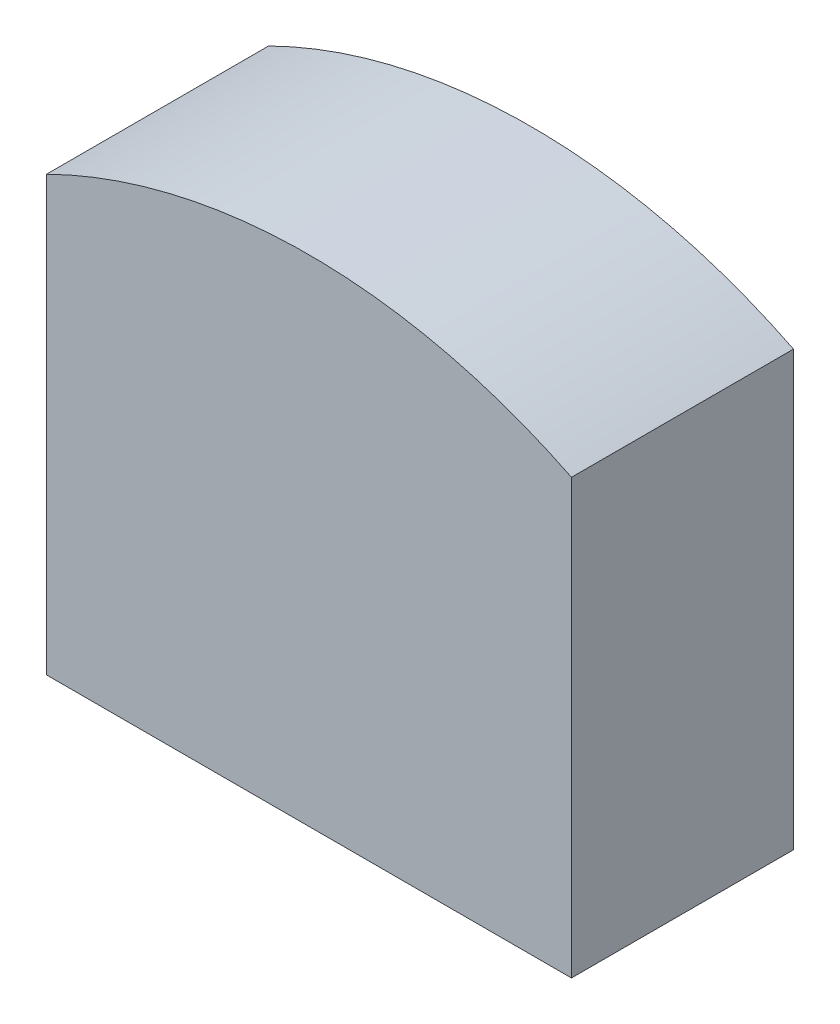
from build123d import *

# Parameters (mm, degrees)
SKETCH1_R          = 28.575
EXTRUDE1_DEPTH     = 10.7442
SKETCH2_OUTSIDE_W  = 75.456
SKETCH2_OUTSIDE_H  = 75.456
CUT_EXTRUDE1_DEPTH = 11.0744


with BuildPart() as part:
    # Sketch1 → Extrude1 (new body)
    with BuildSketch(Plane.XY):
        Circle(SKETCH1_R)
    extrude(amount=EXTRUDE1_DEPTH)

    # Sketch2 outside → Cut-Extrude1 (cut)
    with BuildSketch(Plane.XY.offset(10.7442)):
        Rectangle(SKETCH2_OUTSIDE_W, SKETCH2_OUTSIDE_H)
        with BuildLine():
            Line((12.7, 4.617268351), (-12.7, 4.617268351))
            Line((-12.7, 4.617268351), (-12.7, 25.597668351))
            ThreePointArc((-12.7, 25.597668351), (0, 28.575), (12.7, 25.597668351))
            Line((12.7, 25.597668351), (12.7, 4.617268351))
        make_face(mode=Mode.SUBTRACT)
    extrude(amount=-CUT_EXTRUDE1_DEPTH, mode=Mode.SUBTRACT)


solid = part.part
